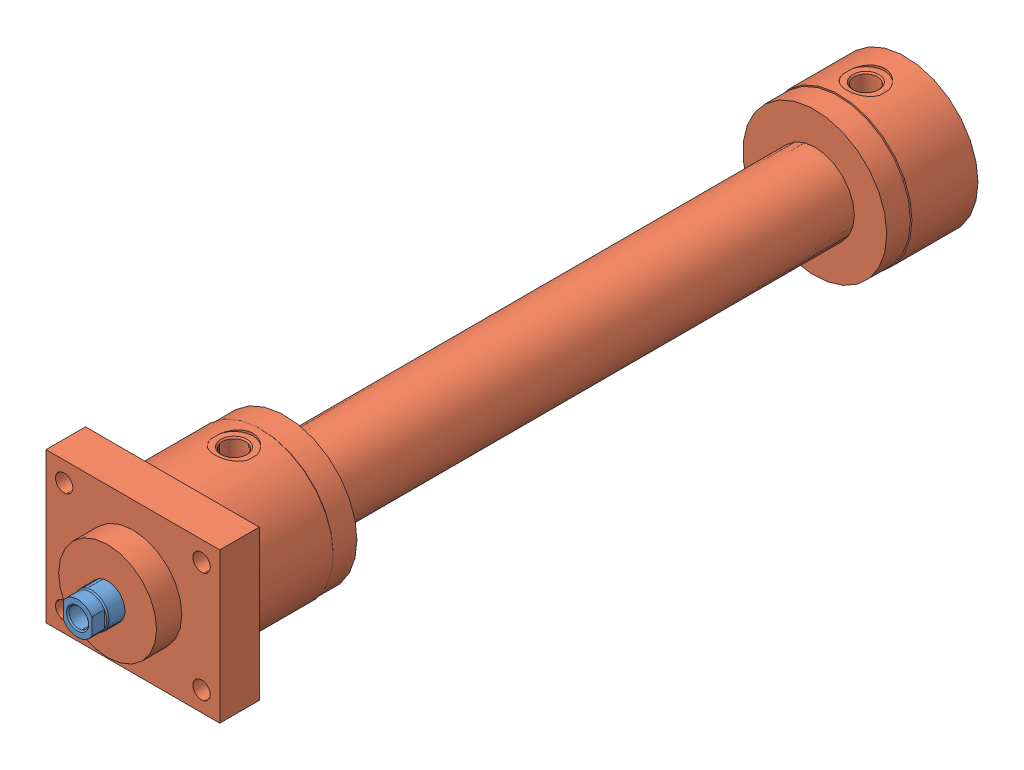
SolidWorks assembly cylinder_vfa_40_mf1_s_2_n_300_l1_0.SLDASM, configuration Default (file format 14000). Lengths in mm.
Overall size (110 95 524).
2 component instances, 2 part files, 0 mates.
Components (placement in the parent):
- cylinder_vfa_40_mf1_s_2_n_300_l1_0_01-1: cylinder_vfa_40_mf1_s_2_n_300_l1_0_01.SLDPRT [Default] at origin size (40 40 454)
- cylinder_vfa_40_mf1_s_2_n_300_l1_0_02-1: cylinder_vfa_40_mf1_s_2_n_300_l1_0_02.SLDPRT [Default] at origin size (110 95 505)
